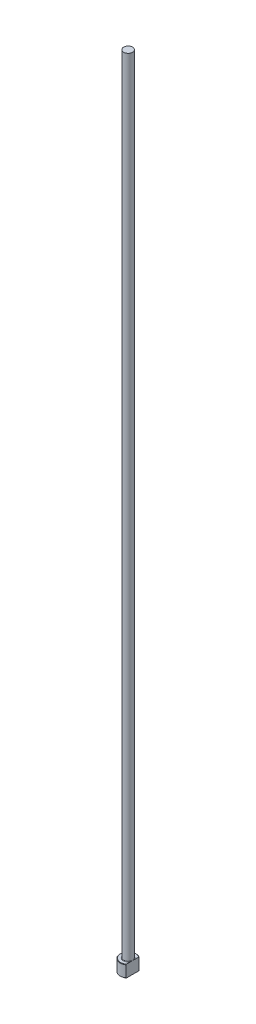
from build123d import *
from build123d.topology import SkipClean

# Parameters (mm, degrees)
CHAMFER1_SIZE    = 0.2
FILLET1_R        = 0.2
KEYED_HEAD_DEPTH = 401.039998


with BuildPart() as part:
    # Sketch1 → Revolve1 (revolve)
    with BuildSketch(Plane.XY, mode=Mode.PRIVATE) as revolve1_sk:
        Polygon((0, 0), (-4, 0), (-4, 6), (-2.25, 6), (-2.25, 400), (0, 400), align=None)
    revolve(revolve1_sk.sketch.rotate(Axis((0, 259.958771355, 0), (0, -1, 0)), 270), axis=Axis((0, 259.958771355, 0), (0, -1, 0)))

    # Chamfer1
    chamfer1_edges = [part.edges().sort_by_distance(p)[0] for p in [
        (0, 6, -4),
        (0, 0, -4),
    ]]
    chamfer(chamfer1_edges, length=CHAMFER1_SIZE)

    # Fillet1
    fillet1_edges = [part.edges().sort_by_distance(p)[0] for p in [
        (0, 6, -2.25),
    ]]
    fillet(fillet1_edges, radius=FILLET1_R)

    # Sketch2 → KEYED HEAD (cut, through all)
    with SkipClean():  # the faces are left unmerged after this step: merging them gives an invalid solid
        with BuildSketch(Plane(origin=(0, 0, 0), x_dir=(1, 0, 0), z_dir=(0, 1, 0))):
            with BuildLine():
                Line((2.25, -3.307189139), (2.25, 3.307189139))
                ThreePointArc((2.25, 3.307189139), (4, 0), (2.25, -3.307189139))
            make_face()
        extrude(amount=KEYED_HEAD_DEPTH, mode=Mode.SUBTRACT)


solid = part.part
